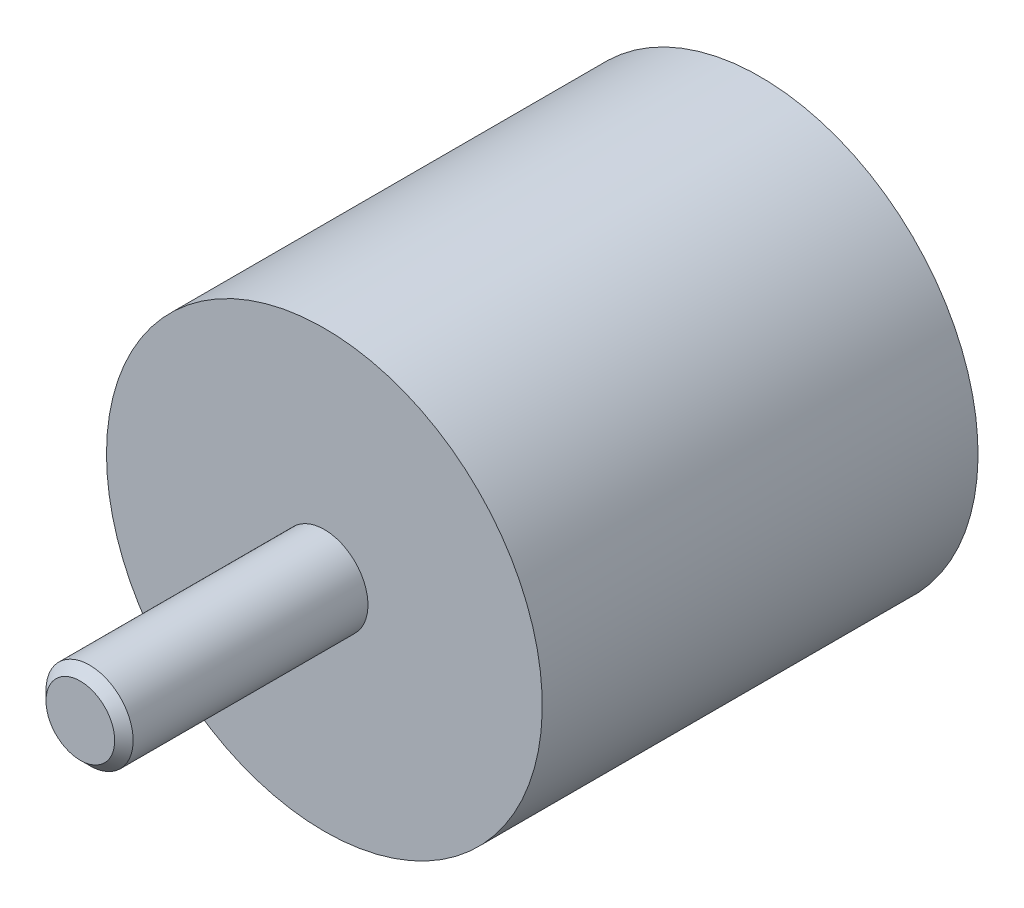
ISO-10303-21;
HEADER;
FILE_DESCRIPTION(('STEP AP214'),'2;1');
FILE_NAME('part.step','',(''),(''),'','','');
FILE_SCHEMA(('AUTOMOTIVE_DESIGN { 1 0 10303 214 1 1 1 1 }'));
ENDSEC;
DATA;
#1=APPLICATION_CONTEXT('core data for automotive mechanical design processes');
#2=APPLICATION_PROTOCOL_DEFINITION('international standard','automotive_design',2000,#1);
#3=PRODUCT_CONTEXT('',#1,'mechanical');
#4=PRODUCT('Part','Part','',(#3));
#5=PRODUCT_RELATED_PRODUCT_CATEGORY('part','',(#4));
#6=PRODUCT_DEFINITION_FORMATION('','',#4);
#7=PRODUCT_DEFINITION_CONTEXT('part definition',#1,'design');
#8=PRODUCT_DEFINITION('design','',#6,#7);
#9=PRODUCT_DEFINITION_SHAPE('','',#8);
#10=(LENGTH_UNIT() NAMED_UNIT(*) SI_UNIT(.MILLI.,.METRE.));
#11=(NAMED_UNIT(*) PLANE_ANGLE_UNIT() SI_UNIT($,.RADIAN.));
#12=(NAMED_UNIT(*) SI_UNIT($,.STERADIAN.) SOLID_ANGLE_UNIT());
#13=UNCERTAINTY_MEASURE_WITH_UNIT(LENGTH_MEASURE(1.E-05),#10,'distance_accuracy_value','');
#14=(GEOMETRIC_REPRESENTATION_CONTEXT(3) GLOBAL_UNCERTAINTY_ASSIGNED_CONTEXT((#13)) GLOBAL_UNIT_ASSIGNED_CONTEXT((#10,
#11,#12)) REPRESENTATION_CONTEXT('',''));
#15=CARTESIAN_POINT('',(0.,0.,0.));
#16=DIRECTION('',(0.,0.,1.));
#17=DIRECTION('',(1.,0.,0.));
#18=AXIS2_PLACEMENT_3D('',#15,#16,#17);
#19=CARTESIAN_POINT('',(0.,0.,0.66666666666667));
#20=DIRECTION('',(0.,0.,1.));
#21=DIRECTION('',(0.,-1.,0.));
#22=AXIS2_PLACEMENT_3D('',#19,#20,#21);
#23=CYLINDRICAL_SURFACE('',#22,25.);
#24=CARTESIAN_POINT('',(0.,0.,0.));
#25=DIRECTION('',(0.,0.,1.));
#26=DIRECTION('',(0.,-1.,0.));
#27=AXIS2_PLACEMENT_3D('',#24,#25,#26);
#28=CIRCLE('',#27,25.);
#29=CARTESIAN_POINT('',(0.,-25.,0.));
#30=VERTEX_POINT('',#29);
#31=EDGE_CURVE('E23',#30,#30,#28,.T.);
#32=ORIENTED_EDGE('',*,*,#31,.T.);
#33=EDGE_LOOP('',(#32));
#34=FACE_BOUND('',#33,.T.);
#35=CARTESIAN_POINT('',(0.,0.,50.));
#36=DIRECTION('',(0.,0.,-1.));
#37=DIRECTION('',(-1.,0.,0.));
#38=AXIS2_PLACEMENT_3D('',#35,#36,#37);
#39=CIRCLE('',#38,25.);
#40=CARTESIAN_POINT('',(-25.,0.,50.));
#41=VERTEX_POINT('',#40);
#42=EDGE_CURVE('E32',#41,#41,#39,.T.);
#43=ORIENTED_EDGE('',*,*,#42,.T.);
#44=EDGE_LOOP('',(#43));
#45=FACE_BOUND('',#44,.T.);
#46=ADVANCED_FACE('F12',(#34,#45),#23,.T.);
#47=CARTESIAN_POINT('',(25.,0.,0.));
#48=DIRECTION('',(0.,0.,-1.));
#49=DIRECTION('',(0.,1.,0.));
#50=AXIS2_PLACEMENT_3D('',#47,#48,#49);
#51=PLANE('',#50);
#52=CARTESIAN_POINT('',(0.,0.,0.));
#53=DIRECTION('',(0.,0.,-1.));
#54=DIRECTION('',(0.,1.,0.));
#55=AXIS2_PLACEMENT_3D('',#52,#53,#54);
#56=CIRCLE('',#55,5.65);
#57=CARTESIAN_POINT('',(0.,5.65,0.));
#58=VERTEX_POINT('',#57);
#59=EDGE_CURVE('E8',#58,#58,#56,.F.);
#60=ORIENTED_EDGE('',*,*,#59,.T.);
#61=EDGE_LOOP('',(#60));
#62=FACE_BOUND('',#61,.T.);
#63=ORIENTED_EDGE('',*,*,#31,.F.);
#64=EDGE_LOOP('',(#63));
#65=FACE_BOUND('',#64,.T.);
#66=ADVANCED_FACE('F58',(#62,#65),#51,.T.);
#67=CARTESIAN_POINT('',(0.,0.,0.));
#68=DIRECTION('',(0.,0.,1.));
#69=DIRECTION('',(0.,-1.,0.));
#70=AXIS2_PLACEMENT_3D('',#67,#68,#69);
#71=CYLINDRICAL_SURFACE('',#70,5.);
#72=CARTESIAN_POINT('',(0.,0.,0.65));
#73=DIRECTION('',(0.,0.,-1.));
#74=DIRECTION('',(0.,1.,0.));
#75=AXIS2_PLACEMENT_3D('',#72,#73,#74);
#76=CIRCLE('',#75,5.);
#77=CARTESIAN_POINT('',(0.,5.,0.65));
#78=VERTEX_POINT('',#77);
#79=EDGE_CURVE('E19',#78,#78,#76,.T.);
#80=ORIENTED_EDGE('',*,*,#79,.T.);
#81=EDGE_LOOP('',(#80));
#82=FACE_BOUND('',#81,.T.);
#83=CARTESIAN_POINT('',(0.,0.,10.));
#84=DIRECTION('',(0.,0.,-1.));
#85=DIRECTION('',(0.,1.,0.));
#86=AXIS2_PLACEMENT_3D('',#83,#84,#85);
#87=CIRCLE('',#86,5.);
#88=CARTESIAN_POINT('',(0.,5.,10.));
#89=VERTEX_POINT('',#88);
#90=EDGE_CURVE('E27',#89,#89,#87,.T.);
#91=ORIENTED_EDGE('',*,*,#90,.F.);
#92=EDGE_LOOP('',(#91));
#93=FACE_BOUND('',#92,.T.);
#94=ADVANCED_FACE('F63',(#82,#93),#71,.F.);
#95=CARTESIAN_POINT('',(0.,0.,10.));
#96=DIRECTION('',(0.,0.,-1.));
#97=DIRECTION('',(0.,1.,0.));
#98=AXIS2_PLACEMENT_3D('',#95,#96,#97);
#99=PLANE('',#98);
#100=ORIENTED_EDGE('',*,*,#90,.T.);
#101=EDGE_LOOP('',(#100));
#102=FACE_BOUND('',#101,.T.);
#103=ADVANCED_FACE('F69',(#102),#99,.T.);
#104=CARTESIAN_POINT('',(0.,0.,0.65));
#105=DIRECTION('',(0.,0.,-1.));
#106=DIRECTION('',(0.,1.,0.));
#107=AXIS2_PLACEMENT_3D('',#104,#105,#106);
#108=CONICAL_SURFACE('',#107,5.,0.785398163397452);
#109=ORIENTED_EDGE('',*,*,#59,.F.);
#110=EDGE_LOOP('',(#109));
#111=FACE_BOUND('',#110,.T.);
#112=ORIENTED_EDGE('',*,*,#79,.F.);
#113=EDGE_LOOP('',(#112));
#114=FACE_BOUND('',#113,.T.);
#115=ADVANCED_FACE('F14',(#111,#114),#108,.F.);
#116=CARTESIAN_POINT('',(0.,25.,50.));
#117=DIRECTION('',(0.,0.,1.));
#118=DIRECTION('',(1.,0.,0.));
#119=AXIS2_PLACEMENT_3D('',#116,#117,#118);
#120=PLANE('',#119);
#121=CARTESIAN_POINT('',(0.,0.,50.));
#122=DIRECTION('',(0.,0.,-1.));
#123=DIRECTION('',(-1.,0.,0.));
#124=AXIS2_PLACEMENT_3D('',#121,#122,#123);
#125=CIRCLE('',#124,5.);
#126=CARTESIAN_POINT('',(-5.,0.,50.));
#127=VERTEX_POINT('',#126);
#128=EDGE_CURVE('E35',#127,#127,#125,.T.);
#129=ORIENTED_EDGE('',*,*,#128,.T.);
#130=EDGE_LOOP('',(#129));
#131=FACE_BOUND('',#130,.T.);
#132=ORIENTED_EDGE('',*,*,#42,.F.);
#133=EDGE_LOOP('',(#132));
#134=FACE_BOUND('',#133,.T.);
#135=ADVANCED_FACE('F73',(#131,#134),#120,.T.);
#136=CARTESIAN_POINT('',(0.,0.,0.));
#137=DIRECTION('',(0.,0.,-1.));
#138=DIRECTION('',(-1.,0.,0.));
#139=AXIS2_PLACEMENT_3D('',#136,#137,#138);
#140=CYLINDRICAL_SURFACE('',#139,5.);
#141=CARTESIAN_POINT('',(0.,0.,76.940261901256));
#142=DIRECTION('',(0.,0.,-1.));
#143=DIRECTION('',(-1.,0.,0.));
#144=AXIS2_PLACEMENT_3D('',#141,#142,#143);
#145=CIRCLE('',#144,5.);
#146=CARTESIAN_POINT('',(-5.,0.,76.940261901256));
#147=VERTEX_POINT('',#146);
#148=EDGE_CURVE('E38',#147,#147,#145,.T.);
#149=ORIENTED_EDGE('',*,*,#148,.T.);
#150=EDGE_LOOP('',(#149));
#151=FACE_BOUND('',#150,.T.);
#152=ORIENTED_EDGE('',*,*,#128,.F.);
#153=EDGE_LOOP('',(#152));
#154=FACE_BOUND('',#153,.T.);
#155=ADVANCED_FACE('F55',(#151,#154),#140,.T.);
#156=CARTESIAN_POINT('',(0.,0.,76.940261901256));
#157=DIRECTION('',(0.,0.,-1.));
#158=DIRECTION('',(-1.,0.,0.));
#159=AXIS2_PLACEMENT_3D('',#156,#157,#158);
#160=CONICAL_SURFACE('',#159,5.,0.785398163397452);
#161=CARTESIAN_POINT('',(0.,0.,78.));
#162=DIRECTION('',(0.,0.,-1.));
#163=DIRECTION('',(-1.,0.,0.));
#164=AXIS2_PLACEMENT_3D('',#161,#162,#163);
#165=CIRCLE('',#164,3.94026190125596);
#166=CARTESIAN_POINT('',(-3.94026190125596,0.,78.));
#167=VERTEX_POINT('',#166);
#168=EDGE_CURVE('E41',#167,#167,#165,.T.);
#169=ORIENTED_EDGE('',*,*,#168,.T.);
#170=EDGE_LOOP('',(#169));
#171=FACE_BOUND('',#170,.T.);
#172=ORIENTED_EDGE('',*,*,#148,.F.);
#173=EDGE_LOOP('',(#172));
#174=FACE_BOUND('',#173,.T.);
#175=ADVANCED_FACE('F45',(#171,#174),#160,.T.);
#176=CARTESIAN_POINT('',(0.,3.94026190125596,78.));
#177=DIRECTION('',(0.,0.,1.));
#178=DIRECTION('',(1.,0.,0.));
#179=AXIS2_PLACEMENT_3D('',#176,#177,#178);
#180=PLANE('',#179);
#181=ORIENTED_EDGE('',*,*,#168,.F.);
#182=EDGE_LOOP('',(#181));
#183=FACE_BOUND('',#182,.T.);
#184=ADVANCED_FACE('F48',(#183),#180,.T.);
#185=CLOSED_SHELL('',(#46,#66,#94,#103,#115,#135,#155,#175,#184));
#186=MANIFOLD_SOLID_BREP('B1',#185);
#187=ADVANCED_BREP_SHAPE_REPRESENTATION('',(#18,#186),#14);
#188=SHAPE_DEFINITION_REPRESENTATION(#9,#187);
ENDSEC;
END-ISO-10303-21;
